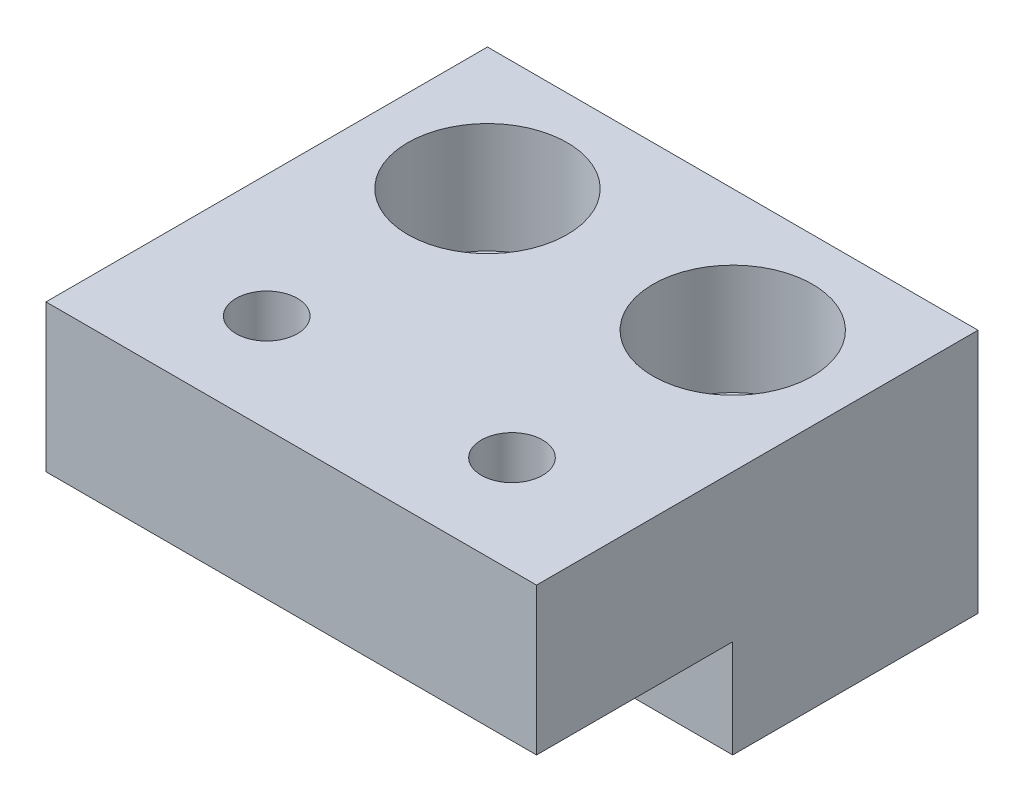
ISO-10303-21;
HEADER;
FILE_DESCRIPTION(('STEP AP214'),'2;1');
FILE_NAME('part.step','',(''),(''),'','','');
FILE_SCHEMA(('AUTOMOTIVE_DESIGN { 1 0 10303 214 1 1 1 1 }'));
ENDSEC;
DATA;
#1=APPLICATION_CONTEXT('core data for automotive mechanical design processes');
#2=APPLICATION_PROTOCOL_DEFINITION('international standard','automotive_design',2000,#1);
#3=PRODUCT_CONTEXT('',#1,'mechanical');
#4=PRODUCT('Part','Part','',(#3));
#5=PRODUCT_RELATED_PRODUCT_CATEGORY('part','',(#4));
#6=PRODUCT_DEFINITION_FORMATION('','',#4);
#7=PRODUCT_DEFINITION_CONTEXT('part definition',#1,'design');
#8=PRODUCT_DEFINITION('design','',#6,#7);
#9=PRODUCT_DEFINITION_SHAPE('','',#8);
#10=(LENGTH_UNIT() NAMED_UNIT(*) SI_UNIT(.MILLI.,.METRE.));
#11=(NAMED_UNIT(*) PLANE_ANGLE_UNIT() SI_UNIT($,.RADIAN.));
#12=(NAMED_UNIT(*) SI_UNIT($,.STERADIAN.) SOLID_ANGLE_UNIT());
#13=UNCERTAINTY_MEASURE_WITH_UNIT(LENGTH_MEASURE(1.E-05),#10,'distance_accuracy_value','');
#14=(GEOMETRIC_REPRESENTATION_CONTEXT(3) GLOBAL_UNCERTAINTY_ASSIGNED_CONTEXT((#13)) GLOBAL_UNIT_ASSIGNED_CONTEXT((#10,
#11,#12)) REPRESENTATION_CONTEXT('',''));
#15=CARTESIAN_POINT('',(0.,0.,0.));
#16=DIRECTION('',(0.,0.,1.));
#17=DIRECTION('',(1.,0.,0.));
#18=AXIS2_PLACEMENT_3D('',#15,#16,#17);
#19=CARTESIAN_POINT('',(15.,10.,5.));
#20=DIRECTION('',(0.,-1.,0.));
#21=DIRECTION('',(0.,0.,-1.));
#22=AXIS2_PLACEMENT_3D('',#19,#20,#21);
#23=CYLINDRICAL_SURFACE('',#22,1.75);
#24=CARTESIAN_POINT('',(15.,0.,5.));
#25=DIRECTION('',(0.,1.,0.));
#26=DIRECTION('',(0.,0.,1.));
#27=AXIS2_PLACEMENT_3D('',#24,#25,#26);
#28=CIRCLE('',#27,1.75);
#29=CARTESIAN_POINT('',(15.,0.,6.75));
#30=VERTEX_POINT('',#29);
#31=EDGE_CURVE('E136',#30,#30,#28,.T.);
#32=ORIENTED_EDGE('',*,*,#31,.F.);
#33=EDGE_LOOP('',(#32));
#34=FACE_BOUND('',#33,.T.);
#35=CARTESIAN_POINT('',(15.,5.5,5.));
#36=DIRECTION('',(0.,1.,0.));
#37=DIRECTION('',(0.,0.,1.));
#38=AXIS2_PLACEMENT_3D('',#35,#36,#37);
#39=CIRCLE('',#38,1.75);
#40=CARTESIAN_POINT('',(15.,5.5,6.75));
#41=VERTEX_POINT('',#40);
#42=EDGE_CURVE('E120',#41,#41,#39,.T.);
#43=ORIENTED_EDGE('',*,*,#42,.T.);
#44=EDGE_LOOP('',(#43));
#45=FACE_BOUND('',#44,.T.);
#46=ADVANCED_FACE('F32',(#34,#45),#23,.F.);
#47=CARTESIAN_POINT('',(5.,10.,5.));
#48=DIRECTION('',(0.,-1.,0.));
#49=DIRECTION('',(0.,0.,-1.));
#50=AXIS2_PLACEMENT_3D('',#47,#48,#49);
#51=CYLINDRICAL_SURFACE('',#50,1.75);
#52=CARTESIAN_POINT('',(5.,0.,5.));
#53=DIRECTION('',(0.,1.,0.));
#54=DIRECTION('',(0.,0.,1.));
#55=AXIS2_PLACEMENT_3D('',#52,#53,#54);
#56=CIRCLE('',#55,1.75);
#57=CARTESIAN_POINT('',(5.,0.,6.75));
#58=VERTEX_POINT('',#57);
#59=EDGE_CURVE('E139',#58,#58,#56,.T.);
#60=ORIENTED_EDGE('',*,*,#59,.F.);
#61=EDGE_LOOP('',(#60));
#62=FACE_BOUND('',#61,.T.);
#63=CARTESIAN_POINT('',(5.,5.5,5.));
#64=DIRECTION('',(0.,1.,0.));
#65=DIRECTION('',(0.,0.,1.));
#66=AXIS2_PLACEMENT_3D('',#63,#64,#65);
#67=CIRCLE('',#66,1.75);
#68=CARTESIAN_POINT('',(5.,5.5,6.75));
#69=VERTEX_POINT('',#68);
#70=EDGE_CURVE('E126',#69,#69,#67,.T.);
#71=ORIENTED_EDGE('',*,*,#70,.T.);
#72=EDGE_LOOP('',(#71));
#73=FACE_BOUND('',#72,.T.);
#74=ADVANCED_FACE('F194',(#62,#73),#51,.F.);
#75=CARTESIAN_POINT('',(20.,10.,18.));
#76=DIRECTION('',(0.,1.,0.));
#77=DIRECTION('',(0.,0.,1.));
#78=AXIS2_PLACEMENT_3D('',#75,#76,#77);
#79=PLANE('',#78);
#80=CARTESIAN_POINT('',(15.,10.,5.));
#81=DIRECTION('',(0.,1.,0.));
#82=DIRECTION('',(0.,0.,1.));
#83=AXIS2_PLACEMENT_3D('',#80,#81,#82);
#84=CIRCLE('',#83,3.25);
#85=CARTESIAN_POINT('',(15.,10.,8.25));
#86=VERTEX_POINT('',#85);
#87=EDGE_CURVE('E104',#86,#86,#84,.T.);
#88=ORIENTED_EDGE('',*,*,#87,.F.);
#89=EDGE_LOOP('',(#88));
#90=FACE_BOUND('',#89,.T.);
#91=CARTESIAN_POINT('',(5.,10.,5.));
#92=DIRECTION('',(0.,1.,0.));
#93=DIRECTION('',(0.,0.,1.));
#94=AXIS2_PLACEMENT_3D('',#91,#92,#93);
#95=CIRCLE('',#94,3.25);
#96=CARTESIAN_POINT('',(5.,10.,8.25));
#97=VERTEX_POINT('',#96);
#98=EDGE_CURVE('E127',#97,#97,#95,.T.);
#99=ORIENTED_EDGE('',*,*,#98,.F.);
#100=EDGE_LOOP('',(#99));
#101=FACE_BOUND('',#100,.T.);
#102=CARTESIAN_POINT('',(5.,10.,14.));
#103=DIRECTION('',(0.,1.,0.));
#104=DIRECTION('',(0.,0.,1.));
#105=AXIS2_PLACEMENT_3D('',#102,#103,#104);
#106=CIRCLE('',#105,1.25);
#107=CARTESIAN_POINT('',(5.,10.,15.25));
#108=VERTEX_POINT('',#107);
#109=EDGE_CURVE('E133',#108,#108,#106,.T.);
#110=ORIENTED_EDGE('',*,*,#109,.F.);
#111=EDGE_LOOP('',(#110));
#112=FACE_BOUND('',#111,.T.);
#113=DIRECTION('',(1.,0.,0.));
#114=VECTOR('',#113,1.);
#115=CARTESIAN_POINT('',(0.,10.,18.));
#116=LINE('',#115,#114);
#117=CARTESIAN_POINT('',(0.,10.,18.));
#118=VERTEX_POINT('',#117);
#119=CARTESIAN_POINT('',(20.,10.,18.));
#120=VERTEX_POINT('',#119);
#121=EDGE_CURVE('E143',#118,#120,#116,.T.);
#122=ORIENTED_EDGE('',*,*,#121,.T.);
#123=DIRECTION('',(0.,0.,-1.));
#124=VECTOR('',#123,1.);
#125=CARTESIAN_POINT('',(20.,10.,18.));
#126=LINE('',#125,#124);
#127=CARTESIAN_POINT('',(20.,10.,0.));
#128=VERTEX_POINT('',#127);
#129=EDGE_CURVE('E80',#120,#128,#126,.T.);
#130=ORIENTED_EDGE('',*,*,#129,.T.);
#131=DIRECTION('',(-1.,0.,0.));
#132=VECTOR('',#131,1.);
#133=CARTESIAN_POINT('',(0.,10.,0.));
#134=LINE('',#133,#132);
#135=CARTESIAN_POINT('',(0.,10.,0.));
#136=VERTEX_POINT('',#135);
#137=EDGE_CURVE('E147',#128,#136,#134,.T.);
#138=ORIENTED_EDGE('',*,*,#137,.T.);
#139=DIRECTION('',(0.,0.,1.));
#140=VECTOR('',#139,1.);
#141=CARTESIAN_POINT('',(0.,10.,18.));
#142=LINE('',#141,#140);
#143=EDGE_CURVE('E56',#136,#118,#142,.T.);
#144=ORIENTED_EDGE('',*,*,#143,.T.);
#145=EDGE_LOOP('',(#122,#130,#138,#144));
#146=FACE_BOUND('',#145,.T.);
#147=CARTESIAN_POINT('',(15.,10.,14.));
#148=DIRECTION('',(0.,1.,0.));
#149=DIRECTION('',(0.,0.,1.));
#150=AXIS2_PLACEMENT_3D('',#147,#148,#149);
#151=CIRCLE('',#150,1.25);
#152=CARTESIAN_POINT('',(15.,10.,15.25));
#153=VERTEX_POINT('',#152);
#154=EDGE_CURVE('E130',#153,#153,#151,.T.);
#155=ORIENTED_EDGE('',*,*,#154,.F.);
#156=EDGE_LOOP('',(#155));
#157=FACE_BOUND('',#156,.T.);
#158=ADVANCED_FACE('F182',(#90,#101,#112,#146,#157),#79,.T.);
#159=CARTESIAN_POINT('',(20.,0.,18.));
#160=DIRECTION('',(0.,1.,0.));
#161=DIRECTION('',(0.,0.,1.));
#162=AXIS2_PLACEMENT_3D('',#159,#160,#161);
#163=PLANE('',#162);
#164=ORIENTED_EDGE('',*,*,#59,.T.);
#165=EDGE_LOOP('',(#164));
#166=FACE_BOUND('',#165,.T.);
#167=DIRECTION('',(0.,0.,-1.));
#168=VECTOR('',#167,1.);
#169=CARTESIAN_POINT('',(20.,0.,18.));
#170=LINE('',#169,#168);
#171=CARTESIAN_POINT('',(20.,0.,10.));
#172=VERTEX_POINT('',#171);
#173=CARTESIAN_POINT('',(20.,0.,0.));
#174=VERTEX_POINT('',#173);
#175=EDGE_CURVE('E142',#172,#174,#170,.T.);
#176=ORIENTED_EDGE('',*,*,#175,.F.);
#177=DIRECTION('',(-1.,0.,0.));
#178=VECTOR('',#177,1.);
#179=CARTESIAN_POINT('',(62.1317502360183,0.,10.));
#180=LINE('',#179,#178);
#181=CARTESIAN_POINT('',(0.,0.,10.));
#182=VERTEX_POINT('',#181);
#183=EDGE_CURVE('E101',#172,#182,#180,.T.);
#184=ORIENTED_EDGE('',*,*,#183,.T.);
#185=DIRECTION('',(0.,0.,1.));
#186=VECTOR('',#185,1.);
#187=CARTESIAN_POINT('',(0.,0.,18.));
#188=LINE('',#187,#186);
#189=CARTESIAN_POINT('',(0.,0.,0.));
#190=VERTEX_POINT('',#189);
#191=EDGE_CURVE('E145',#190,#182,#188,.T.);
#192=ORIENTED_EDGE('',*,*,#191,.F.);
#193=DIRECTION('',(-1.,0.,0.));
#194=VECTOR('',#193,1.);
#195=CARTESIAN_POINT('',(0.,0.,0.));
#196=LINE('',#195,#194);
#197=EDGE_CURVE('E72',#174,#190,#196,.T.);
#198=ORIENTED_EDGE('',*,*,#197,.F.);
#199=EDGE_LOOP('',(#176,#184,#192,#198));
#200=FACE_BOUND('',#199,.T.);
#201=ORIENTED_EDGE('',*,*,#31,.T.);
#202=EDGE_LOOP('',(#201));
#203=FACE_BOUND('',#202,.T.);
#204=ADVANCED_FACE('F176',(#166,#200,#203),#163,.F.);
#205=CARTESIAN_POINT('',(0.,10.,18.));
#206=DIRECTION('',(0.,0.,-1.));
#207=DIRECTION('',(-1.,0.,0.));
#208=AXIS2_PLACEMENT_3D('',#205,#206,#207);
#209=PLANE('',#208);
#210=DIRECTION('',(0.,-1.,0.));
#211=VECTOR('',#210,1.);
#212=CARTESIAN_POINT('',(0.,10.,18.));
#213=LINE('',#212,#211);
#214=CARTESIAN_POINT('',(0.,4.,18.));
#215=VERTEX_POINT('',#214);
#216=EDGE_CURVE('E150',#118,#215,#213,.T.);
#217=ORIENTED_EDGE('',*,*,#216,.T.);
#218=DIRECTION('',(-1.,0.,0.));
#219=VECTOR('',#218,1.);
#220=CARTESIAN_POINT('',(62.1317502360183,4.,18.));
#221=LINE('',#220,#219);
#222=CARTESIAN_POINT('',(20.,4.,18.));
#223=VERTEX_POINT('',#222);
#224=EDGE_CURVE('E47',#223,#215,#221,.T.);
#225=ORIENTED_EDGE('',*,*,#224,.F.);
#226=DIRECTION('',(0.,-1.,0.));
#227=VECTOR('',#226,1.);
#228=CARTESIAN_POINT('',(20.,10.,18.));
#229=LINE('',#228,#227);
#230=EDGE_CURVE('E112',#120,#223,#229,.T.);
#231=ORIENTED_EDGE('',*,*,#230,.F.);
#232=ORIENTED_EDGE('',*,*,#121,.F.);
#233=EDGE_LOOP('',(#217,#225,#231,#232));
#234=FACE_BOUND('',#233,.T.);
#235=ADVANCED_FACE('F34',(#234),#209,.F.);
#236=CARTESIAN_POINT('',(20.,10.,18.));
#237=DIRECTION('',(-1.,0.,0.));
#238=DIRECTION('',(0.,0.,1.));
#239=AXIS2_PLACEMENT_3D('',#236,#237,#238);
#240=PLANE('',#239);
#241=DIRECTION('',(0.,0.,-1.));
#242=VECTOR('',#241,1.);
#243=CARTESIAN_POINT('',(20.,4.,18.));
#244=LINE('',#243,#242);
#245=CARTESIAN_POINT('',(20.,4.,10.));
#246=VERTEX_POINT('',#245);
#247=EDGE_CURVE('E105',#223,#246,#244,.T.);
#248=ORIENTED_EDGE('',*,*,#247,.T.);
#249=DIRECTION('',(0.,-1.,0.));
#250=VECTOR('',#249,1.);
#251=CARTESIAN_POINT('',(20.,10.,10.));
#252=LINE('',#251,#250);
#253=EDGE_CURVE('E96',#246,#172,#252,.T.);
#254=ORIENTED_EDGE('',*,*,#253,.T.);
#255=ORIENTED_EDGE('',*,*,#175,.T.);
#256=DIRECTION('',(0.,-1.,0.));
#257=VECTOR('',#256,1.);
#258=CARTESIAN_POINT('',(20.,10.,0.));
#259=LINE('',#258,#257);
#260=EDGE_CURVE('E159',#128,#174,#259,.T.);
#261=ORIENTED_EDGE('',*,*,#260,.F.);
#262=ORIENTED_EDGE('',*,*,#129,.F.);
#263=ORIENTED_EDGE('',*,*,#230,.T.);
#264=EDGE_LOOP('',(#248,#254,#255,#261,#262,#263));
#265=FACE_BOUND('',#264,.T.);
#266=ADVANCED_FACE('F110',(#265),#240,.F.);
#267=CARTESIAN_POINT('',(0.,10.,0.));
#268=DIRECTION('',(0.,0.,1.));
#269=DIRECTION('',(1.,0.,0.));
#270=AXIS2_PLACEMENT_3D('',#267,#268,#269);
#271=PLANE('',#270);
#272=ORIENTED_EDGE('',*,*,#197,.T.);
#273=DIRECTION('',(0.,-1.,0.));
#274=VECTOR('',#273,1.);
#275=CARTESIAN_POINT('',(0.,10.,0.));
#276=LINE('',#275,#274);
#277=EDGE_CURVE('E157',#136,#190,#276,.T.);
#278=ORIENTED_EDGE('',*,*,#277,.F.);
#279=ORIENTED_EDGE('',*,*,#137,.F.);
#280=ORIENTED_EDGE('',*,*,#260,.T.);
#281=EDGE_LOOP('',(#272,#278,#279,#280));
#282=FACE_BOUND('',#281,.T.);
#283=ADVANCED_FACE('F181',(#282),#271,.F.);
#284=CARTESIAN_POINT('',(0.,10.,18.));
#285=DIRECTION('',(1.,0.,0.));
#286=DIRECTION('',(0.,0.,-1.));
#287=AXIS2_PLACEMENT_3D('',#284,#285,#286);
#288=PLANE('',#287);
#289=ORIENTED_EDGE('',*,*,#191,.T.);
#290=DIRECTION('',(0.,1.,0.));
#291=VECTOR('',#290,1.);
#292=CARTESIAN_POINT('',(0.,10.,10.));
#293=LINE('',#292,#291);
#294=CARTESIAN_POINT('',(0.,4.,10.));
#295=VERTEX_POINT('',#294);
#296=EDGE_CURVE('E11',#182,#295,#293,.T.);
#297=ORIENTED_EDGE('',*,*,#296,.T.);
#298=DIRECTION('',(0.,0.,1.));
#299=VECTOR('',#298,1.);
#300=CARTESIAN_POINT('',(0.,4.,18.));
#301=LINE('',#300,#299);
#302=EDGE_CURVE('E108',#295,#215,#301,.T.);
#303=ORIENTED_EDGE('',*,*,#302,.T.);
#304=ORIENTED_EDGE('',*,*,#216,.F.);
#305=ORIENTED_EDGE('',*,*,#143,.F.);
#306=ORIENTED_EDGE('',*,*,#277,.T.);
#307=EDGE_LOOP('',(#289,#297,#303,#304,#305,#306));
#308=FACE_BOUND('',#307,.T.);
#309=ADVANCED_FACE('F179',(#308),#288,.F.);
#310=CARTESIAN_POINT('',(5.,10.,14.));
#311=DIRECTION('',(0.,-1.,0.));
#312=DIRECTION('',(0.,0.,-1.));
#313=AXIS2_PLACEMENT_3D('',#310,#311,#312);
#314=CYLINDRICAL_SURFACE('',#313,1.25);
#315=CARTESIAN_POINT('',(5.,4.,14.));
#316=DIRECTION('',(0.,1.,0.));
#317=DIRECTION('',(0.,0.,1.));
#318=AXIS2_PLACEMENT_3D('',#315,#316,#317);
#319=CIRCLE('',#318,1.25);
#320=CARTESIAN_POINT('',(5.,4.,15.25));
#321=VERTEX_POINT('',#320);
#322=EDGE_CURVE('E40',#321,#321,#319,.T.);
#323=ORIENTED_EDGE('',*,*,#322,.F.);
#324=EDGE_LOOP('',(#323));
#325=FACE_BOUND('',#324,.T.);
#326=ORIENTED_EDGE('',*,*,#109,.T.);
#327=EDGE_LOOP('',(#326));
#328=FACE_BOUND('',#327,.T.);
#329=ADVANCED_FACE('F205',(#325,#328),#314,.F.);
#330=CARTESIAN_POINT('',(15.,10.,14.));
#331=DIRECTION('',(0.,-1.,0.));
#332=DIRECTION('',(0.,0.,-1.));
#333=AXIS2_PLACEMENT_3D('',#330,#331,#332);
#334=CYLINDRICAL_SURFACE('',#333,1.25);
#335=CARTESIAN_POINT('',(15.,4.,14.));
#336=DIRECTION('',(0.,1.,0.));
#337=DIRECTION('',(0.,0.,1.));
#338=AXIS2_PLACEMENT_3D('',#335,#336,#337);
#339=CIRCLE('',#338,1.25);
#340=CARTESIAN_POINT('',(15.,4.,15.25));
#341=VERTEX_POINT('',#340);
#342=EDGE_CURVE('E162',#341,#341,#339,.T.);
#343=ORIENTED_EDGE('',*,*,#342,.F.);
#344=EDGE_LOOP('',(#343));
#345=FACE_BOUND('',#344,.T.);
#346=ORIENTED_EDGE('',*,*,#154,.T.);
#347=EDGE_LOOP('',(#346));
#348=FACE_BOUND('',#347,.T.);
#349=ADVANCED_FACE('F228',(#345,#348),#334,.F.);
#350=CARTESIAN_POINT('',(5.,5.5,5.));
#351=DIRECTION('',(0.,1.,0.));
#352=DIRECTION('',(0.,0.,1.));
#353=AXIS2_PLACEMENT_3D('',#350,#351,#352);
#354=CYLINDRICAL_SURFACE('',#353,3.25);
#355=CARTESIAN_POINT('',(5.,5.5,5.));
#356=DIRECTION('',(0.,1.,0.));
#357=DIRECTION('',(0.,0.,1.));
#358=AXIS2_PLACEMENT_3D('',#355,#356,#357);
#359=CIRCLE('',#358,3.25);
#360=CARTESIAN_POINT('',(5.,5.5,8.25));
#361=VERTEX_POINT('',#360);
#362=EDGE_CURVE('E123',#361,#361,#359,.T.);
#363=ORIENTED_EDGE('',*,*,#362,.F.);
#364=EDGE_LOOP('',(#363));
#365=FACE_BOUND('',#364,.T.);
#366=ORIENTED_EDGE('',*,*,#98,.T.);
#367=EDGE_LOOP('',(#366));
#368=FACE_BOUND('',#367,.T.);
#369=ADVANCED_FACE('F235',(#365,#368),#354,.F.);
#370=CARTESIAN_POINT('',(5.,5.5,5.));
#371=DIRECTION('',(0.,1.,0.));
#372=DIRECTION('',(0.,0.,1.));
#373=AXIS2_PLACEMENT_3D('',#370,#371,#372);
#374=PLANE('',#373);
#375=ORIENTED_EDGE('',*,*,#70,.F.);
#376=EDGE_LOOP('',(#375));
#377=FACE_BOUND('',#376,.T.);
#378=ORIENTED_EDGE('',*,*,#362,.T.);
#379=EDGE_LOOP('',(#378));
#380=FACE_BOUND('',#379,.T.);
#381=ADVANCED_FACE('F243',(#377,#380),#374,.T.);
#382=CARTESIAN_POINT('',(15.,5.5,5.));
#383=DIRECTION('',(0.,1.,0.));
#384=DIRECTION('',(0.,0.,1.));
#385=AXIS2_PLACEMENT_3D('',#382,#383,#384);
#386=CYLINDRICAL_SURFACE('',#385,3.25);
#387=CARTESIAN_POINT('',(15.,5.5,5.));
#388=DIRECTION('',(0.,1.,0.));
#389=DIRECTION('',(0.,0.,1.));
#390=AXIS2_PLACEMENT_3D('',#387,#388,#389);
#391=CIRCLE('',#390,3.25);
#392=CARTESIAN_POINT('',(15.,5.5,8.25));
#393=VERTEX_POINT('',#392);
#394=EDGE_CURVE('E117',#393,#393,#391,.T.);
#395=ORIENTED_EDGE('',*,*,#394,.F.);
#396=EDGE_LOOP('',(#395));
#397=FACE_BOUND('',#396,.T.);
#398=ORIENTED_EDGE('',*,*,#87,.T.);
#399=EDGE_LOOP('',(#398));
#400=FACE_BOUND('',#399,.T.);
#401=ADVANCED_FACE('F252',(#397,#400),#386,.F.);
#402=CARTESIAN_POINT('',(15.,5.5,5.));
#403=DIRECTION('',(0.,1.,0.));
#404=DIRECTION('',(0.,0.,1.));
#405=AXIS2_PLACEMENT_3D('',#402,#403,#404);
#406=PLANE('',#405);
#407=ORIENTED_EDGE('',*,*,#42,.F.);
#408=EDGE_LOOP('',(#407));
#409=FACE_BOUND('',#408,.T.);
#410=ORIENTED_EDGE('',*,*,#394,.T.);
#411=EDGE_LOOP('',(#410));
#412=FACE_BOUND('',#411,.T.);
#413=ADVANCED_FACE('F260',(#409,#412),#406,.T.);
#414=CARTESIAN_POINT('',(62.1317502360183,0.,10.));
#415=DIRECTION('',(0.,0.,-1.));
#416=DIRECTION('',(-1.,0.,0.));
#417=AXIS2_PLACEMENT_3D('',#414,#415,#416);
#418=PLANE('',#417);
#419=ORIENTED_EDGE('',*,*,#253,.F.);
#420=DIRECTION('',(-1.,0.,0.));
#421=VECTOR('',#420,1.);
#422=CARTESIAN_POINT('',(62.1317502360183,4.,10.));
#423=LINE('',#422,#421);
#424=EDGE_CURVE('E99',#246,#295,#423,.T.);
#425=ORIENTED_EDGE('',*,*,#424,.T.);
#426=ORIENTED_EDGE('',*,*,#296,.F.);
#427=ORIENTED_EDGE('',*,*,#183,.F.);
#428=EDGE_LOOP('',(#419,#425,#426,#427));
#429=FACE_BOUND('',#428,.T.);
#430=ADVANCED_FACE('F98',(#429),#418,.F.);
#431=CARTESIAN_POINT('',(62.1317502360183,4.,18.));
#432=DIRECTION('',(0.,1.,0.));
#433=DIRECTION('',(0.,0.,1.));
#434=AXIS2_PLACEMENT_3D('',#431,#432,#433);
#435=PLANE('',#434);
#436=ORIENTED_EDGE('',*,*,#322,.T.);
#437=EDGE_LOOP('',(#436));
#438=FACE_BOUND('',#437,.T.);
#439=ORIENTED_EDGE('',*,*,#342,.T.);
#440=EDGE_LOOP('',(#439));
#441=FACE_BOUND('',#440,.T.);
#442=ORIENTED_EDGE('',*,*,#247,.F.);
#443=ORIENTED_EDGE('',*,*,#224,.T.);
#444=ORIENTED_EDGE('',*,*,#302,.F.);
#445=ORIENTED_EDGE('',*,*,#424,.F.);
#446=EDGE_LOOP('',(#442,#443,#444,#445));
#447=FACE_BOUND('',#446,.T.);
#448=ADVANCED_FACE('F107',(#438,#441,#447),#435,.F.);
#449=CLOSED_SHELL('',(#46,#74,#158,#204,#235,#266,#283,#309,#329,#349,#369,#381,#401,#413,#430,#448));
#450=MANIFOLD_SOLID_BREP('B2',#449);
#451=ADVANCED_BREP_SHAPE_REPRESENTATION('',(#18,#450),#14);
#452=SHAPE_DEFINITION_REPRESENTATION(#9,#451);
ENDSEC;
END-ISO-10303-21;
